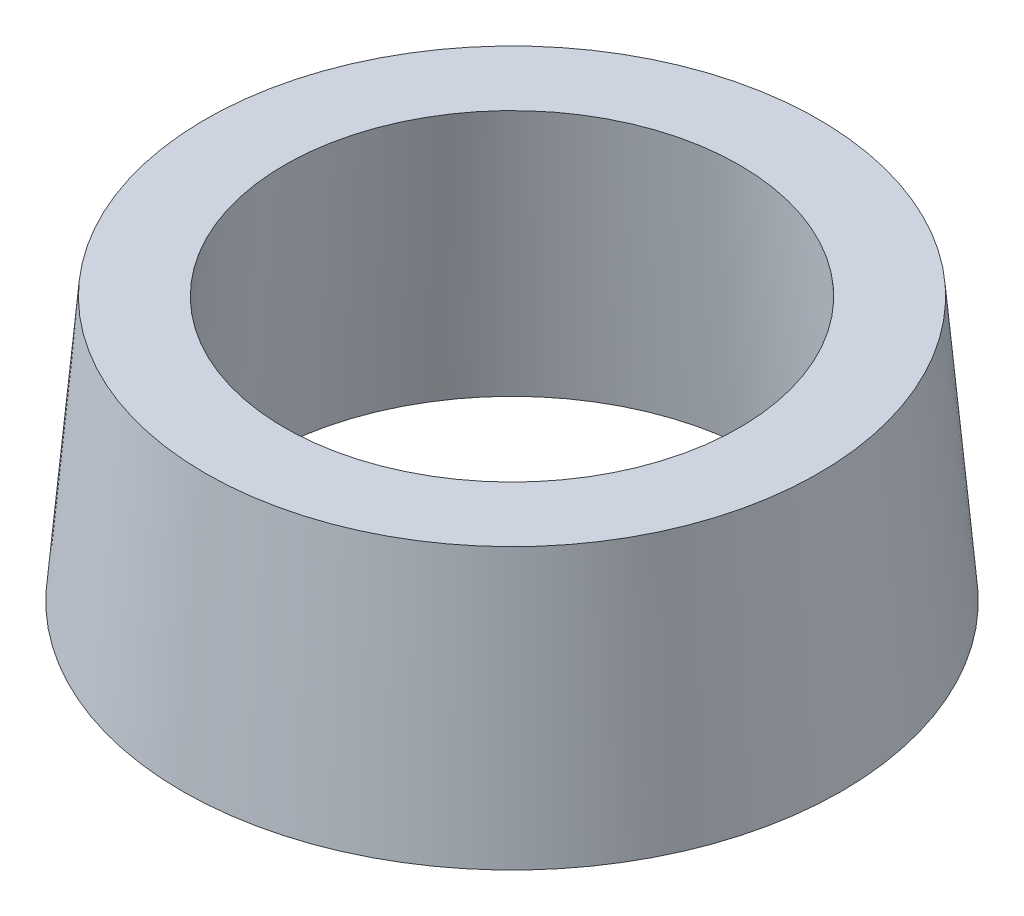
ISO-10303-21;
HEADER;
FILE_DESCRIPTION(('STEP AP214'),'2;1');
FILE_NAME('part.step','',(''),(''),'','','');
FILE_SCHEMA(('AUTOMOTIVE_DESIGN { 1 0 10303 214 1 1 1 1 }'));
ENDSEC;
DATA;
#1=APPLICATION_CONTEXT('core data for automotive mechanical design processes');
#2=APPLICATION_PROTOCOL_DEFINITION('international standard','automotive_design',2000,#1);
#3=PRODUCT_CONTEXT('',#1,'mechanical');
#4=PRODUCT('Part','Part','',(#3));
#5=PRODUCT_RELATED_PRODUCT_CATEGORY('part','',(#4));
#6=PRODUCT_DEFINITION_FORMATION('','',#4);
#7=PRODUCT_DEFINITION_CONTEXT('part definition',#1,'design');
#8=PRODUCT_DEFINITION('design','',#6,#7);
#9=PRODUCT_DEFINITION_SHAPE('','',#8);
#10=(LENGTH_UNIT() NAMED_UNIT(*) SI_UNIT(.MILLI.,.METRE.));
#11=(NAMED_UNIT(*) PLANE_ANGLE_UNIT() SI_UNIT($,.RADIAN.));
#12=(NAMED_UNIT(*) SI_UNIT($,.STERADIAN.) SOLID_ANGLE_UNIT());
#13=UNCERTAINTY_MEASURE_WITH_UNIT(LENGTH_MEASURE(1.E-05),#10,'distance_accuracy_value','');
#14=(GEOMETRIC_REPRESENTATION_CONTEXT(3) GLOBAL_UNCERTAINTY_ASSIGNED_CONTEXT((#13)) GLOBAL_UNIT_ASSIGNED_CONTEXT((#10,
#11,#12)) REPRESENTATION_CONTEXT('',''));
#15=CARTESIAN_POINT('',(0.,0.,0.));
#16=DIRECTION('',(0.,0.,1.));
#17=DIRECTION('',(1.,0.,0.));
#18=AXIS2_PLACEMENT_3D('',#15,#16,#17);
#19=CARTESIAN_POINT('',(0.,0.,0.));
#20=DIRECTION('',(0.,-1.,0.));
#21=DIRECTION('',(0.,0.,1.));
#22=AXIS2_PLACEMENT_3D('',#19,#20,#21);
#23=CONICAL_SURFACE('',#22,6.25,0.0872664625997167);
#24=CARTESIAN_POINT('',(0.,5.,0.));
#25=DIRECTION('',(0.,1.,0.));
#26=DIRECTION('',(0.,0.,1.));
#27=AXIS2_PLACEMENT_3D('',#24,#25,#26);
#28=CIRCLE('',#27,5.81255668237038);
#29=CARTESIAN_POINT('',(0.,5.,5.81255668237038));
#30=VERTEX_POINT('',#29);
#31=EDGE_CURVE('E10',#30,#30,#28,.T.);
#32=ORIENTED_EDGE('',*,*,#31,.F.);
#33=EDGE_LOOP('',(#32));
#34=FACE_BOUND('',#33,.T.);
#35=CARTESIAN_POINT('',(0.,0.,0.));
#36=DIRECTION('',(0.,1.,0.));
#37=DIRECTION('',(0.,0.,1.));
#38=AXIS2_PLACEMENT_3D('',#35,#36,#37);
#39=CIRCLE('',#38,6.25);
#40=CARTESIAN_POINT('',(0.,0.,6.25));
#41=VERTEX_POINT('',#40);
#42=EDGE_CURVE('E44',#41,#41,#39,.T.);
#43=ORIENTED_EDGE('',*,*,#42,.T.);
#44=EDGE_LOOP('',(#43));
#45=FACE_BOUND('',#44,.T.);
#46=ADVANCED_FACE('F37',(#34,#45),#23,.T.);
#47=CARTESIAN_POINT('',(0.,5.,0.));
#48=DIRECTION('',(0.,1.,0.));
#49=DIRECTION('',(0.,0.,1.));
#50=AXIS2_PLACEMENT_3D('',#47,#48,#49);
#51=PLANE('',#50);
#52=CARTESIAN_POINT('',(0.,5.,0.));
#53=DIRECTION('',(0.,-1.,0.));
#54=DIRECTION('',(0.,0.,-1.));
#55=AXIS2_PLACEMENT_3D('',#52,#53,#54);
#56=CIRCLE('',#55,4.31255668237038);
#57=CARTESIAN_POINT('',(0.,5.,-4.31255668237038));
#58=VERTEX_POINT('',#57);
#59=EDGE_CURVE('E49',#58,#58,#56,.T.);
#60=ORIENTED_EDGE('',*,*,#59,.T.);
#61=EDGE_LOOP('',(#60));
#62=FACE_BOUND('',#61,.T.);
#63=ORIENTED_EDGE('',*,*,#31,.T.);
#64=EDGE_LOOP('',(#63));
#65=FACE_BOUND('',#64,.T.);
#66=ADVANCED_FACE('F66',(#62,#65),#51,.T.);
#67=CARTESIAN_POINT('',(0.,0.,0.));
#68=DIRECTION('',(0.,1.,0.));
#69=DIRECTION('',(0.,0.,1.));
#70=AXIS2_PLACEMENT_3D('',#67,#68,#69);
#71=PLANE('',#70);
#72=CARTESIAN_POINT('',(0.,0.,0.));
#73=DIRECTION('',(0.,-1.,0.));
#74=DIRECTION('',(0.,0.,-1.));
#75=AXIS2_PLACEMENT_3D('',#72,#73,#74);
#76=CIRCLE('',#75,4.75);
#77=CARTESIAN_POINT('',(0.,0.,-4.75));
#78=VERTEX_POINT('',#77);
#79=EDGE_CURVE('E54',#78,#78,#76,.T.);
#80=ORIENTED_EDGE('',*,*,#79,.F.);
#81=EDGE_LOOP('',(#80));
#82=FACE_BOUND('',#81,.T.);
#83=ORIENTED_EDGE('',*,*,#42,.F.);
#84=EDGE_LOOP('',(#83));
#85=FACE_BOUND('',#84,.T.);
#86=ADVANCED_FACE('F63',(#82,#85),#71,.F.);
#87=CARTESIAN_POINT('',(0.,0.,0.));
#88=DIRECTION('',(0.,-1.,0.));
#89=DIRECTION('',(0.,0.,-1.));
#90=AXIS2_PLACEMENT_3D('',#87,#88,#89);
#91=CONICAL_SURFACE('',#90,4.75,0.0872664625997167);
#92=ORIENTED_EDGE('',*,*,#59,.F.);
#93=EDGE_LOOP('',(#92));
#94=FACE_BOUND('',#93,.T.);
#95=ORIENTED_EDGE('',*,*,#79,.T.);
#96=EDGE_LOOP('',(#95));
#97=FACE_BOUND('',#96,.T.);
#98=ADVANCED_FACE('F61',(#94,#97),#91,.F.);
#99=CLOSED_SHELL('',(#46,#66,#86,#98));
#100=MANIFOLD_SOLID_BREP('B2',#99);
#101=ADVANCED_BREP_SHAPE_REPRESENTATION('',(#18,#100),#14);
#102=SHAPE_DEFINITION_REPRESENTATION(#9,#101);
ENDSEC;
END-ISO-10303-21;
